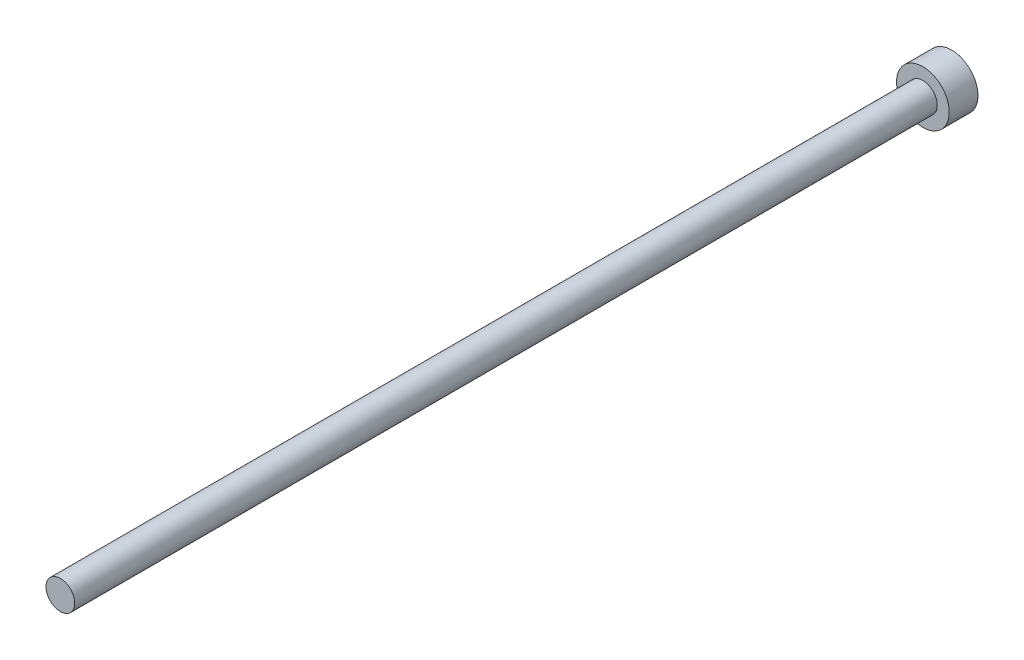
from build123d import *

# Parameters (mm, degrees)
HEAD_ENVELOPE_START             = -3
SKETCH_1_R                      = 2.75
HEAD_ENVELOPE_DEPTH             = 3
SKETCH_2_R                      = 1.5
SHANK_ENVELOPE_NO_THREADS_DEPTH = 90


with BuildPart() as part:
    # Sketch 1 → Head_envelope (new body)
    with BuildSketch(Plane.XY.offset(HEAD_ENVELOPE_START)):
        Circle(SKETCH_1_R)
    extrude(amount=HEAD_ENVELOPE_DEPTH)

    # Sketch 2 → Shank_envelope_no_threads (add)
    with BuildSketch(Plane.XY):
        with Locations(Location((0, 0, 0), (0, 0, 180))):
            Circle(SKETCH_2_R)
    extrude(amount=SHANK_ENVELOPE_NO_THREADS_DEPTH)


solid = part.part
